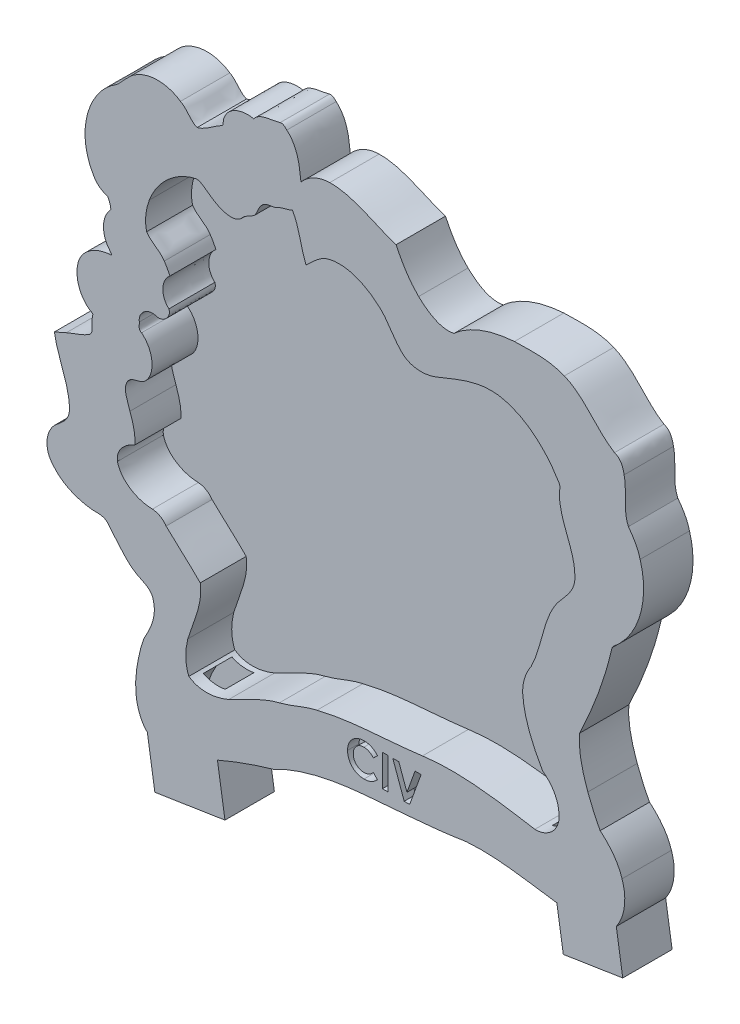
from build123d import *

# Parameters (mm, degrees)
BOSS_EXTRUDE1_DEPTH = 8.6
BOSS_EXTRUDE2_DEPTH = 0.6
BOSS_EXTRUDE3_DEPTH = 8.6
CUT_EXTRUDE1_DEPTH  = 9
CUT_EXTRUDE3_DEPTH  = 7
CUT_EXTRUDE4_DEPTH  = 5
BOSS_EXTRUDE4_DEPTH = 2
FILLET1_R           = 1.2
SKETCH8_W           = 12.358072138
SKETCH8_H           = 8.6
SKETCH8_W_2         = 6.650626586
SKETCH8_H_2         = 5
SKETCH8_W_3         = 10.47326114
SKETCH8_W_4         = 6.059963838
BOSS_EXTRUDE5_DEPTH = 6
SKETCH9_W           = 0.987179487
SKETCH9_H           = 5.5
CUT_EXTRUDE5_DEPTH  = 2


with BuildPart() as part:
    # Model → Boss-Extrude1 (new body)
    with BuildSketch(Plane.XY):
        with BuildLine():
            add(Edge.make_bspline(
                [(84.777274, 159.10405), (84.468177, 159.41369), (84.088604, 159.79081), (83.609375, 159.64258)],
                knots=[0, 0, 0, 0, 1, 1, 1, 1], degree=3))
            add(Edge.make_bspline(
                [(83.609375, 159.64258), (82.141161, 159.19474), (80.077447, 159.37023), (79.03125, 157.92578)],
                knots=[0, 0, 0, 0, 1, 1, 1, 1], degree=3))
            add(Edge.make_bspline(
                [(79.03125, 157.92578), (77.084114, 158.34017), (74.613561, 157.5729), (73.886163, 155.55754)],
                knots=[0, 0, 0, 0, 1, 1, 1, 1], degree=3))
            add(Edge.make_bspline(
                [(73.886163, 155.55754), (73.629028, 155.13557), (73.796103, 154.52343), (73.542969, 154.17969)],
                knots=[0, 0, 0, 0, 1, 1, 1, 1], degree=3))
            add(Edge.make_bspline(
                [(73.542969, 154.17969), (72.044006, 153.40073), (70.800965, 152.12238), (69.142578, 151.66602)],
                knots=[0, 0, 0, 0, 1, 1, 1, 1], degree=3))
            add(Edge.make_bspline(
                [(69.142578, 151.66602), (67.938616, 152.18434), (67.426087, 153.57769), (66.252499, 154.16312)],
                knots=[0, 0, 0, 0, 1, 1, 1, 1], degree=3))
            add(Edge.make_bspline(
                [(66.252499, 154.16312), (63.628824, 156.0179), (59.782498, 155.70484), (57.445387, 153.51493)],
                knots=[0, 0, 0, 0, 1, 1, 1, 1], degree=3))
            add(Edge.make_bspline(
                [(57.445387, 153.51493), (56.380806, 152.58489), (55.637907, 151.30748), (54.359375, 150.63281)],
                knots=[0, 0, 0, 0, 1, 1, 1, 1], degree=3))
            add(Edge.make_bspline(
                [(54.359375, 150.63281), (49.840483, 147.27546), (48.17057, 140.42041), (51.099609, 135.51562)],
                knots=[0, 0, 0, 0, 1, 1, 1, 1], degree=3))
            add(Edge.make_bspline(
                [(51.099609, 135.51562), (51.548143, 134.48517), (52.556507, 133.82301), (53.591797, 133.47852)],
                knots=[0, 0, 0, 0, 1, 1, 1, 1], degree=3))
            add(Edge.make_bspline(
                [(53.591797, 133.47852), (53.913485, 132.99047), (54.090052, 132.3166), (54.136719, 131.78516)],
                knots=[0, 0, 0, 0, 1, 1, 1, 1], degree=3))
            add(Edge.make_bspline(
                [(54.136719, 131.78516), (52.5399, 130.17487), (52.407137, 127.38825), (53.874883, 125.64915)],
                knots=[0, 0, 0, 0, 1, 1, 1, 1], degree=3))
            add(Edge.make_bspline(
                [(53.874883, 125.64915), (54.20396, 125.21086), (54.557045, 124.85928), (53.745025, 124.9402)],
                knots=[0, 0, 0, 0, 1, 1, 1, 1], degree=3))
            add(Edge.make_bspline(
                [(53.745025, 124.9402), (51.364138, 124.68498), (48.857309, 123.16093), (48.372928, 120.66886)],
                knots=[0, 0, 0, 0, 1, 1, 1, 1], degree=3))
            add(Edge.make_bspline(
                [(48.372928, 120.66886), (47.876912, 118.39673), (48.781595, 115.64199), (50.943697, 114.56226)],
                knots=[0, 0, 0, 0, 1, 1, 1, 1], degree=3))
            add(Edge.make_bspline(
                [(50.943697, 114.56226), (51.097487, 114.28234), (50.78108, 113.74694), (50.837891, 113.35352)],
                knots=[0, 0, 0, 0, 1, 1, 1, 1], degree=3))
            add(Edge.make_bspline(
                [(50.837891, 113.35352), (50.752211, 112.57159), (51.180243, 111.59567), (50.358109, 111.0754)],
                knots=[0, 0, 0, 0, 1, 1, 1, 1], degree=3))
            add(Edge.make_bspline(
                [(50.358109, 111.0754), (49.141954, 110.27494), (47.679958, 109.94679), (46.365234, 109.33789)],
                knots=[0, 0, 0, 0, 1, 1, 1, 1], degree=3))
            add(Edge.make_bspline(
                [(46.365234, 109.33789), (45.672135, 109.04939), (44.989226, 108.73772), (44.304688, 108.42969)],
                knots=[0, 0, 0, 0, 1, 1, 1, 1], degree=3))
            add(Edge.make_bspline(
                [(44.304688, 108.42969), (44.85508, 104.79267), (47.090446, 101.51388), (46.90625, 97.75586)],
                knots=[0, 0, 0, 0, 1, 1, 1, 1], degree=3))
            add(Edge.make_bspline(
                [(46.90625, 97.75586), (46.780681, 96.24275), (45.45133, 95.30477), (44.383935, 94.42033)],
                knots=[0, 0, 0, 0, 1, 1, 1, 1], degree=3))
            add(Edge.make_bspline(
                [(44.383935, 94.42033), (42.816741, 92.8466), (42.466403, 90.06665), (43.987901, 88.34007)],
                knots=[0, 0, 0, 0, 1, 1, 1, 1], degree=3))
            add(Edge.make_bspline(
                [(43.987901, 88.34007), (45.613584, 86.21692), (48.318639, 85.18661), (50.90625, 84.92188)],
                knots=[0, 0, 0, 0, 1, 1, 1, 1], degree=3))
            add(Edge.make_bspline(
                [(50.90625, 84.92188), (51.914018, 84.91588), (53.14548, 84.99338), (53.777156, 84.03101)],
                knots=[0, 0, 0, 0, 1, 1, 1, 1], degree=3))
            add(Edge.make_bspline(
                [(53.777156, 84.03101), (55.458497, 82.17471), (56.824453, 79.87312), (59.189593, 78.79146)],
                knots=[0, 0, 0, 0, 1, 1, 1, 1], degree=3))
            add(Edge.make_bspline(
                [(59.189593, 78.79146), (60.175291, 78.34588), (61.306432, 77.79058), (61.510856, 76.60474)],
                knots=[0, 0, 0, 0, 1, 1, 1, 1], degree=3))
            add(Edge.make_bspline(
                [(61.510856, 76.60474), (62.179142, 74.27785), (61.002486, 71.97806), (59.886719, 70)],
                knots=[0, 0, 0, 0, 1, 1, 1, 1], degree=3))
            add(Edge.make_bspline(
                [(59.886719, 70), (59.253545, 68.32192), (58.923581, 66.53876), (58.633837, 64.77322)],
                knots=[0, 0, 0, 0, 1, 1, 1, 1], degree=3))
            add(Edge.make_bspline(
                [(58.633837, 64.77322), (58.272795, 62.16539), (58.32458, 59.28321), (59.785156, 56.99805)],
                knots=[0, 0, 0, 0, 1, 1, 1, 1], degree=3))
            add(Edge.make_bspline(
                [(59.785156, 56.99805), (60.921031, 55.34014), (63.056631, 54.04296), (65.095163, 54.66478)],
                knots=[0, 0, 0, 0, 1, 1, 1, 1], degree=3))
            add(Edge.make_bspline(
                [(65.095163, 54.66478), (67.679095, 55.67918), (70.119506, 57.02079), (72.694339, 58.05993)],
                knots=[0, 0, 0, 0, 1, 1, 1, 1], degree=3))
            add(Edge.make_bspline(
                [(72.694339, 58.05993), (75.888521, 59.43673), (79.111415, 60.60095), (82.455078, 61.54102)],
                knots=[0, 0, 0, 0, 1, 1, 1, 1], degree=3))
            add(Edge.make_bspline(
                [(82.455078, 61.54102), (87.319231, 64.16138), (92.959143, 65.15362), (98.437342, 65.64746)],
                knots=[0, 0, 0, 0, 1, 1, 1, 1], degree=3))
            add(Edge.make_bspline(
                [(98.437342, 65.64746), (104.28334, 66.18985), (110.16312, 66.46583), (115.96309, 67.41091)],
                knots=[0, 0, 0, 0, 1, 1, 1, 1], degree=3))
            add(Edge.make_bspline(
                [(115.96309, 67.41091), (123.48644, 68.02547), (130.76223, 65.62781), (138.2699, 65.58984)],
                knots=[0, 0, 0, 0, 1, 1, 1, 1], degree=3))
            add(Edge.make_bspline(
                [(138.2699, 65.58984), (139.65001, 65.41252), (140.98553, 66.12685), (141.78042, 67.23289)],
                knots=[0, 0, 0, 0, 1, 1, 1, 1], degree=3))
            add(Edge.make_bspline(
                [(141.78042, 67.23289), (143.63628, 69.47282), (144.0926, 72.66155), (143.14309, 75.38475)],
                knots=[0, 0, 0, 0, 1, 1, 1, 1], degree=3))
            add(Edge.make_bspline(
                [(143.14309, 75.38475), (142.48654, 77.52852), (141.01884, 79.30607), (139.33398, 80.73633)],
                knots=[0, 0, 0, 0, 1, 1, 1, 1], degree=3))
            add(Edge.make_bspline(
                [(139.33398, 80.73633), (138.47369, 82.27666), (137.81532, 83.9058), (137.1875, 85.5)],
                knots=[0, 0, 0, 0, 1, 1, 1, 1], degree=3))
            add(Edge.make_bspline(
                [(137.1875, 85.5), (136.2405, 88.08813), (135.503, 90.87195), (135.74381, 93.63733)],
                knots=[0, 0, 0, 0, 1, 1, 1, 1], degree=3))
            add(Edge.make_bspline(
                [(135.74381, 93.63733), (138.16903, 98.66062), (140.17845, 103.90679), (141.39686, 109.35659)],
                knots=[0, 0, 0, 0, 1, 1, 1, 1], degree=3))
            add(Edge.make_bspline(
                [(141.39686, 109.35659), (141.6693, 109.91296), (142.34758, 110.1873), (142.73674, 110.68477)],
                knots=[0, 0, 0, 0, 1, 1, 1, 1], degree=3))
            add(Edge.make_bspline(
                [(142.73674, 110.68477), (146.44498, 114.36532), (147.81684, 120.13631), (146.28908, 125.1169)],
                knots=[0, 0, 0, 0, 1, 1, 1, 1], degree=3))
            add(Edge.make_bspline(
                [(146.28908, 125.1169), (145.94595, 126.57367), (145.13855, 127.86313), (144.25434, 129.03914)],
                knots=[0, 0, 0, 0, 1, 1, 1, 1], degree=3))
            add(Edge.make_bspline(
                [(144.25434, 129.03914), (143.24678, 131.39664), (144.06997, 134.02262), (143.50195, 136.46875)],
                knots=[0, 0, 0, 0, 1, 1, 1, 1], degree=3))
            add(Edge.make_bspline(
                [(143.50195, 136.46875), (143.35348, 137.49579), (142.91279, 138.62965), (141.83984, 138.98242)],
                knots=[0, 0, 0, 0, 1, 1, 1, 1], degree=3))
            add(Edge.make_bspline(
                [(141.83984, 138.98242), (138.58984, 140.97524), (136.70518, 144.70986), (133.09255, 146.19165)],
                knots=[0, 0, 0, 0, 1, 1, 1, 1], degree=3))
            add(Edge.make_bspline(
                [(133.09255, 146.19165), (130.35081, 147.32411), (127.30994, 147.07447), (124.41314, 147.03829)],
                knots=[0, 0, 0, 0, 1, 1, 1, 1], degree=3))
            add(Edge.make_bspline(
                [(124.41314, 147.03829), (120.61848, 146.77934), (116.74935, 145.58235), (113.88477, 142.99414)],
                knots=[0, 0, 0, 0, 1, 1, 1, 1], degree=3))
            add(Edge.make_bspline(
                [(113.88477, 142.99414), (111.54639, 142.4763), (109.35134, 143.95652), (107.72414, 145.47911)],
                knots=[0, 0, 0, 0, 1, 1, 1, 1], degree=3))
            add(Edge.make_bspline(
                [(107.72414, 145.47911), (106.01903, 147.12893), (104.80917, 149.20956), (103.80469, 151.33984)],
                knots=[0, 0, 0, 0, 1, 1, 1, 1], degree=3))
            add(Edge.make_bspline(
                [(103.80469, 151.33984), (99.956761, 152.52601), (96.404354, 155.0099), (92.241428, 154.91561)],
                knots=[0, 0, 0, 0, 1, 1, 1, 1], degree=3))
            add(Edge.make_bspline(
                [(92.241428, 154.91561), (90.325709, 154.89451), (88.47389, 153.94986), (87.238281, 152.50195)],
                knots=[0, 0, 0, 0, 1, 1, 1, 1], degree=3))
            add(Edge.make_bspline(
                [(87.238281, 152.50195), (87.007138, 154.83975), (86.658092, 157.46441), (84.777274, 159.10405)],
                knots=[0, 0, 0, 0, 1, 1, 1, 1], degree=3))
        make_face()
        with BuildLine():
            Line((85.681641, 147.48438), (85.757812, 147.5156))
            add(Edge.make_bspline(
                [(88.107422, 140.43748), (87.156385, 142.74207), (87.008605, 145.33338), (85.757812, 147.5156)],
                knots=[0, 0, 0, 0, 1, 1, 1, 1], degree=3))
            add(Edge.make_bspline(
                [(91.570461, 143.12642), (90.19888, 142.55245), (89.197091, 141.40538), (88.107422, 140.43748)],
                knots=[0, 0, 0, 0, 1, 1, 1, 1], degree=3))
            add(Edge.make_bspline(
                [(100.50977, 140.791), (98.121047, 142.86258), (94.688008, 144.19285), (91.570461, 143.12642)],
                knots=[0, 0, 0, 0, 1, 1, 1, 1], degree=3))
            add(Edge.make_bspline(
                [(104.69922, 135.7031), (103.12008, 137.25044), (102.30638, 139.44097), (100.50977, 140.791)],
                knots=[0, 0, 0, 0, 1, 1, 1, 1], degree=3))
            add(Edge.make_bspline(
                [(110.68761, 134.83691), (108.73076, 134.09977), (106.23355, 134.08409), (104.69922, 135.7031)],
                knots=[0, 0, 0, 0, 1, 1, 1, 1], degree=3))
            add(Edge.make_bspline(
                [(121.56076, 137.55119), (117.72325, 138.00381), (114.16041, 136.1769), (110.68761, 134.83691)],
                knots=[0, 0, 0, 0, 1, 1, 1, 1], degree=3))
            add(Edge.make_bspline(
                [(132.00747, 129.84895), (129.80466, 133.57708), (126.03678, 136.88787), (121.56076, 137.55119)],
                knots=[0, 0, 0, 0, 1, 1, 1, 1], degree=3))
            add(Edge.make_bspline(
                [(132.24059, 128.09973), (132.28939, 128.71011), (132.49444, 129.34951), (132.00747, 129.84895)],
                knots=[0, 0, 0, 0, 1, 1, 1, 1], degree=3))
            add(Edge.make_bspline(
                [(134.92773, 116.72264), (135.04959, 120.72322), (132.12261, 124.10104), (132.24059, 128.09973)],
                knots=[0, 0, 0, 0, 1, 1, 1, 1], degree=3))
            add(Edge.make_bspline(
                [(132.02702, 111.5261), (133.25207, 113.07313), (134.98725, 114.57336), (134.92773, 116.72264)],
                knots=[0, 0, 0, 0, 1, 1, 1, 1], degree=3))
            add(Edge.make_bspline(
                [(127.33094, 99.51803), (129.28315, 103.36659), (129.31382, 108.03558), (132.02702, 111.5261)],
                knots=[0, 0, 0, 0, 1, 1, 1, 1], degree=3))
            add(Edge.make_bspline(
                [(125.84648, 94.70584), (125.76148, 96.43155), (126.38089, 98.10414), (127.33094, 99.51803)],
                knots=[0, 0, 0, 0, 1, 1, 1, 1], degree=3))
            add(Edge.make_bspline(
                [(129.31836, 84.71873), (127.55306, 87.77795), (126.06737, 91.13889), (125.84648, 94.70584)],
                knots=[0, 0, 0, 0, 1, 1, 1, 1], degree=3))
            add(Edge.make_bspline(
                [(132.16016, 79.35154), (132.21996, 81.47708), (131.03946, 83.51705), (129.31836, 84.71873)],
                knots=[0, 0, 0, 0, 1, 1, 1, 1], degree=3))
            add(Edge.make_bspline(
                [(127.96132, 75.25623), (130.17311, 75.15023), (132.29016, 77.09312), (132.16016, 79.35154)],
                knots=[0, 0, 0, 0, 1, 1, 1, 1], degree=3))
            add(Edge.make_bspline(
                [(108.39726, 76.54069), (114.93639, 77.4379), (121.51792, 76.32783), (127.96132, 75.25623)],
                knots=[0, 0, 0, 0, 1, 1, 1, 1], degree=3))
            add(Edge.make_bspline(
                [(90.032689, 74.25223), (96.043142, 75.75683), (102.30238, 75.70623), (108.39726, 76.54069)],
                knots=[0, 0, 0, 0, 1, 1, 1, 1], degree=3))
            add(Edge.make_bspline(
                [(83.479116, 72.08373), (85.720293, 72.63612), (87.76964, 73.76368), (90.032689, 74.25223)],
                knots=[0, 0, 0, 0, 1, 1, 1, 1], degree=3))
            add(Edge.make_bspline(
                [(74.674295, 68.1915), (77.61364, 69.4782), (80.319672, 71.33531), (83.479116, 72.08373)],
                knots=[0, 0, 0, 0, 1, 1, 1, 1], degree=3))
            add(Edge.make_bspline(
                [(67.712891, 68.1875), (69.77754, 66.78018), (72.514987, 67.25506), (74.674295, 68.1915)],
                knots=[0, 0, 0, 0, 1, 1, 1, 1], degree=3))
            add(Edge.make_bspline(
                [(67.533203, 73.75195), (67.083035, 71.9353), (66.977161, 69.94571), (67.712891, 68.1875)],
                knots=[0, 0, 0, 0, 1, 1, 1, 1], degree=3))
            add(Edge.make_bspline(
                [(69.699219, 83.28125), (70.164582, 79.92827), (68.42213, 76.87363), (67.533203, 73.75195)],
                knots=[0, 0, 0, 0, 1, 1, 1, 1], degree=3))
            add(Edge.make_bspline(
                [(63.756112, 88.87367), (65.691999, 86.96187), (67.807507, 85.23863), (69.699219, 83.28125)],
                knots=[0, 0, 0, 0, 1, 1, 1, 1], degree=3))
            add(Edge.make_bspline(
                [(61.36512, 90.2389), (62.327259, 90.1837), (63.225479, 89.67271), (63.756112, 88.87367)],
                knots=[0, 0, 0, 0, 1, 1, 1, 1], degree=3))
            add(Edge.make_bspline(
                [(55.28125, 94.38281), (55.963136, 91.74776), (58.808244, 90.30499), (61.36512, 90.2389)],
                knots=[0, 0, 0, 0, 1, 1, 1, 1], degree=3))
            add(Edge.make_bspline(
                [(58.314453, 98.38672), (56.71591, 97.74491), (55.00402, 96.28347), (55.28125, 94.38281)],
                knots=[0, 0, 0, 0, 1, 1, 1, 1], degree=3))
            add(Edge.make_bspline(
                [(57.458364, 103.05389), (57.993998, 101.56089), (58.452303, 99.99063), (58.314453, 98.38672)],
                knots=[0, 0, 0, 0, 1, 1, 1, 1], degree=3))
            add(Edge.make_bspline(
                [(57.029297, 107.32031), (56.201774, 105.95555), (57.043617, 104.40152), (57.458364, 103.05389)],
                knots=[0, 0, 0, 0, 1, 1, 1, 1], degree=3))
            add(Edge.make_bspline(
                [(59.96875, 108.80859), (59.06305, 108.07737), (57.67634, 108.40941), (57.029297, 107.32031)],
                knots=[0, 0, 0, 0, 1, 1, 1, 1], degree=3))
            add(Edge.make_bspline(
                [(59.46875, 115.88867), (61.577874, 114.25614), (62.036218, 110.6537), (59.96875, 108.80859)],
                knots=[0, 0, 0, 0, 1, 1, 1, 1], degree=3))
            add(Edge.make_bspline(
                [(59.092019, 117.33561), (59.120599, 116.8423), (58.874201, 116.12241), (59.46875, 115.88867)],
                knots=[0, 0, 0, 0, 1, 1, 1, 1], degree=3))
            add(Edge.make_bspline(
                [(62.158203, 119.63477), (60.710656, 120.2653), (58.858607, 118.92796), (59.092019, 117.33561)],
                knots=[0, 0, 0, 0, 1, 1, 1, 1], degree=3))
            add(Edge.make_bspline(
                [(64.245555, 121.88344), (64.663353, 120.7167), (63.372078, 119.39146), (62.158203, 119.63477)],
                knots=[0, 0, 0, 0, 1, 1, 1, 1], degree=3))
            add(Edge.make_bspline(
                [(64.425781, 126.92383), (62.881413, 125.7278), (62.742364, 123.16713), (64.245555, 121.88344)],
                knots=[0, 0, 0, 0, 1, 1, 1, 1], degree=3))
            add(Edge.make_bspline(
                [(63.438508, 128.67166), (63.838976, 128.13226), (64.113944, 127.51546), (64.425781, 126.92383)],
                knots=[0, 0, 0, 0, 1, 1, 1, 1], degree=3))
            add(Edge.make_bspline(
                [(60.371094, 131.57227), (61.12557, 130.34534), (62.677853, 129.91076), (63.438508, 128.67166)],
                knots=[0, 0, 0, 0, 1, 1, 1, 1], degree=3))
            add(Edge.make_bspline(
                [(60.824103, 136.57173), (60.256458, 134.99075), (59.955673, 133.21783), (60.371094, 131.57227)],
                knots=[0, 0, 0, 0, 1, 1, 1, 1], degree=3))
            add(Edge.make_bspline(
                [(69.083412, 143.89142), (65.315125, 143.10436), (62.169394, 140.13324), (60.824103, 136.57173)],
                knots=[0, 0, 0, 0, 1, 1, 1, 1], degree=3))
            add(Edge.make_bspline(
                [(72.189008, 142.07664), (71.12207, 142.61362), (70.290287, 143.70087), (69.083412, 143.89142)],
                knots=[0, 0, 0, 0, 1, 1, 1, 1], degree=3))
            add(Edge.make_bspline(
                [(76.847463, 141.79286), (75.501166, 140.61898), (73.533237, 141.22623), (72.189008, 142.07664)],
                knots=[0, 0, 0, 0, 1, 1, 1, 1], degree=3))
            add(Edge.make_bspline(
                [(79.199219, 143.48047), (78.459432, 142.84888), (77.388427, 142.64993), (76.847463, 141.79286)],
                knots=[0, 0, 0, 0, 1, 1, 1, 1], degree=3))
            add(Edge.make_bspline(
                [(80.438813, 145.58777), (79.819668, 145.01994), (79.654631, 144.12998), (79.199219, 143.48047)],
                knots=[0, 0, 0, 0, 1, 1, 1, 1], degree=3))
            add(Edge.make_bspline(
                [(83.001376, 146.50076), (82.154743, 146.15491), (81.06421, 146.39581), (80.438813, 145.58777)],
                knots=[0, 0, 0, 0, 1, 1, 1, 1], degree=3))
            add(Edge.make_bspline(
                [(85.681641, 147.48438), (84.820765, 147.05893), (83.807682, 147.05547), (83.001376, 146.50076)],
                knots=[0, 0, 0, 0, 1, 1, 1, 1], degree=3))
        make_face(mode=Mode.SUBTRACT)
    extrude(amount=BOSS_EXTRUDE1_DEPTH)

    # Sketch2 → Boss-Extrude2 (add)
    with BuildSketch(Plane.XY):
        with BuildLine():
            add(Edge.make_bspline(
                [(85.959024, 149.27534), (85.136244, 149.08211), (84.411679, 148.50358), (83.53125, 148.55469)],
                knots=[0, 0, 0, 0, 1, 1, 1, 1], degree=3))
            add(Edge.make_bspline(
                [(83.53125, 148.55469), (82.880216, 148.40682), (82.417948, 147.70048), (81.703277, 147.87632)],
                knots=[0, 0, 0, 0, 1, 1, 1, 1], degree=3))
            add(Edge.make_bspline(
                [(81.703277, 147.87632), (79.931562, 147.73358), (78.569126, 146.23354), (78.058594, 144.61328)],
                knots=[0, 0, 0, 0, 1, 1, 1, 1], degree=3))
            add(Edge.make_bspline(
                [(78.058594, 144.61328), (77.428435, 144.07713), (76.442136, 143.99779), (76.009483, 143.20084)],
                knots=[0, 0, 0, 0, 1, 1, 1, 1], degree=3))
            add(Edge.make_bspline(
                [(76.009483, 143.20084), (75.563506, 142.58451), (74.77522, 142.62034), (74.153441, 142.90349)],
                knots=[0, 0, 0, 0, 1, 1, 1, 1], degree=3))
            add(Edge.make_bspline(
                [(74.153441, 142.90349), (72.441761, 143.46073), (71.220121, 144.99192), (69.527344, 145.54102)],
                knots=[0, 0, 0, 0, 1, 1, 1, 1], degree=3))
            add(Edge.make_bspline(
                [(69.527344, 145.54102), (68.031369, 145.53202), (66.643955, 144.81669), (65.33745, 144.15664)],
                knots=[0, 0, 0, 0, 1, 1, 1, 1], degree=3))
            add(Edge.make_bspline(
                [(65.33745, 144.15664), (61.063505, 141.7378), (58.060432, 136.79579), (58.66357, 131.81553)],
                knots=[0, 0, 0, 0, 1, 1, 1, 1], degree=3))
            add(Edge.make_bspline(
                [(58.66357, 131.81553), (58.771561, 130.7199), (59.501499, 129.82367), (60.430243, 129.28789)],
                knots=[0, 0, 0, 0, 1, 1, 1, 1], degree=3))
            add(Edge.make_bspline(
                [(60.430243, 129.28789), (61.209459, 128.67895), (62.125179, 128.03573), (62.529297, 127.13086)],
                knots=[0, 0, 0, 0, 1, 1, 1, 1], degree=3))
            add(Edge.make_bspline(
                [(62.529297, 127.13086), (61.194257, 125.47774), (61.276645, 122.91992), (62.646484, 121.32031)],
                knots=[0, 0, 0, 0, 1, 1, 1, 1], degree=3))
            add(Edge.make_bspline(
                [(62.646484, 121.32031), (62.521392, 121.01864), (62.084249, 121.43927), (61.838388, 121.35261)],
                knots=[0, 0, 0, 0, 1, 1, 1, 1], degree=3))
            add(Edge.make_bspline(
                [(61.838388, 121.35261), (59.81373, 121.6143), (57.59944, 120.08356), (57.549631, 117.94975)],
                knots=[0, 0, 0, 0, 1, 1, 1, 1], degree=3))
            add(Edge.make_bspline(
                [(57.549631, 117.94975), (57.421663, 117.00127), (57.472541, 116.03053), (57.703125, 115.10151)],
                knots=[0, 0, 0, 0, 1, 1, 1, 1], degree=3))
            add(Edge.make_bspline(
                [(57.703125, 115.10151), (59.481766, 114.37443), (60.380211, 111.9589), (59.220925, 110.3442)],
                knots=[0, 0, 0, 0, 1, 1, 1, 1], degree=3))
            add(Edge.make_bspline(
                [(59.220925, 110.3442), (58.869092, 109.60036), (57.887801, 109.94475), (57.298211, 109.51916)],
                knots=[0, 0, 0, 0, 1, 1, 1, 1], degree=3))
            add(Edge.make_bspline(
                [(57.298211, 109.51916), (55.770678, 108.85549), (54.791427, 107.13697), (55.142578, 105.48237)],
                knots=[0, 0, 0, 0, 1, 1, 1, 1], degree=3))
            add(Edge.make_bspline(
                [(55.142578, 105.48237), (55.350632, 103.3588), (56.68768, 101.49854), (56.716797, 99.34565)],
                knots=[0, 0, 0, 0, 1, 1, 1, 1], degree=3))
            add(Edge.make_bspline(
                [(56.716797, 99.34565), (54.785421, 98.33398), (53.164283, 96.1246), (53.763946, 93.86478)],
                knots=[0, 0, 0, 0, 1, 1, 1, 1], degree=3))
            add(Edge.make_bspline(
                [(53.763946, 93.86478), (54.516106, 90.93497), (57.463739, 89.15129), (60.304688, 88.72261)],
                knots=[0, 0, 0, 0, 1, 1, 1, 1], degree=3))
            add(Edge.make_bspline(
                [(60.304688, 88.72261), (60.959344, 88.51035), (61.834, 88.90315), (62.224607, 88.15557)],
                knots=[0, 0, 0, 0, 1, 1, 1, 1], degree=3))
            add(Edge.make_bspline(
                [(62.224607, 88.15557), (64.107837, 86.20226), (66.259038, 84.52947), (68.150391, 82.58393)],
                knots=[0, 0, 0, 0, 1, 1, 1, 1], degree=3))
            add(Edge.make_bspline(
                [(68.150391, 82.58393), (68.418273, 79.22512), (66.270547, 76.34332), (65.769531, 73.10933)],
                knots=[0, 0, 0, 0, 1, 1, 1, 1], degree=3))
            add(Edge.make_bspline(
                [(65.769531, 73.10933), (65.436925, 71.16654), (65.516257, 69.05948), (66.378225, 67.26473)],
                knots=[0, 0, 0, 0, 1, 1, 1, 1], degree=3))
            add(Edge.make_bspline(
                [(66.378225, 67.26473), (66.920662, 66.49543), (67.938665, 66.27225), (68.78125, 65.97065)],
                knots=[0, 0, 0, 0, 1, 1, 1, 1], degree=3))
            add(Edge.make_bspline(
                [(68.78125, 65.97065), (71.525545, 65.24163), (74.387296, 66.12562), (76.803849, 67.44559)],
                knots=[0, 0, 0, 0, 1, 1, 1, 1], degree=3))
            add(Edge.make_bspline(
                [(76.803849, 67.44559), (79.360201, 68.71653), (81.853212, 70.23486), (84.723907, 70.72844)],
                knots=[0, 0, 0, 0, 1, 1, 1, 1], degree=3))
            add(Edge.make_bspline(
                [(84.723907, 70.72844), (86.652823, 71.39139), (88.494283, 72.31128), (90.502407, 72.737)],
                knots=[0, 0, 0, 0, 1, 1, 1, 1], degree=3))
            add(Edge.make_bspline(
                [(90.502407, 72.737), (96.516809, 74.24539), (102.74072, 74.08391), (108.85083, 75.0252)],
                knots=[0, 0, 0, 0, 1, 1, 1, 1], degree=3))
            add(Edge.make_bspline(
                [(108.85083, 75.0252), (115.02796, 75.72786), (121.1862, 74.86926), (127.26106, 73.70841)],
                knots=[0, 0, 0, 0, 1, 1, 1, 1], degree=3))
            add(Edge.make_bspline(
                [(127.26106, 73.70841), (129.99315, 73.32881), (133.02234, 75.0915), (133.55837, 77.89953)],
                knots=[0, 0, 0, 0, 1, 1, 1, 1], degree=3))
            add(Edge.make_bspline(
                [(133.55837, 77.89953), (134.29777, 80.82102), (132.91359, 84.01491), (130.53711, 85.77925)],
                knots=[0, 0, 0, 0, 1, 1, 1, 1], degree=3))
            add(Edge.make_bspline(
                [(130.53711, 85.77925), (129.53297, 87.36196), (128.86151, 89.11647), (128.20017, 90.89727)],
                knots=[0, 0, 0, 0, 1, 1, 1, 1], degree=3))
            add(Edge.make_bspline(
                [(128.20017, 90.89727), (127.56095, 92.82513), (127.13987, 94.8346), (127.6925, 96.83567)],
                knots=[0, 0, 0, 0, 1, 1, 1, 1], degree=3))
            add(Edge.make_bspline(
                [(127.6925, 96.83567), (128.3613, 98.20931), (129.26454, 99.4718), (129.67217, 100.96594)],
                knots=[0, 0, 0, 0, 1, 1, 1, 1], degree=3))
            add(Edge.make_bspline(
                [(129.67217, 100.96594), (130.85858, 104.3517), (131.21918, 108.09024), (133.56651, 110.9528)],
                knots=[0, 0, 0, 0, 1, 1, 1, 1], degree=3))
            add(Edge.make_bspline(
                [(133.56651, 110.9528), (135.04258, 112.48811), (136.54458, 114.33576), (136.50668, 116.58648)],
                knots=[0, 0, 0, 0, 1, 1, 1, 1], degree=3))
            add(Edge.make_bspline(
                [(136.50668, 116.58648), (136.70718, 119.84364), (134.95487, 122.73935), (134.11444, 125.74983)],
                knots=[0, 0, 0, 0, 1, 1, 1, 1], degree=3))
            add(Edge.make_bspline(
                [(134.11444, 125.74983), (133.76975, 126.93648), (133.69233, 128.22338), (134.06254, 129.41401)],
                knots=[0, 0, 0, 0, 1, 1, 1, 1], degree=3))
            add(Edge.make_bspline(
                [(134.06254, 129.41401), (131.72256, 134.06238), (127.50139, 138.027), (122.2891, 139.0644)],
                knots=[0, 0, 0, 0, 1, 1, 1, 1], degree=3))
            add(Edge.make_bspline(
                [(122.2891, 139.0644), (118.41886, 139.71342), (114.62895, 138.21909), (111.14717, 136.69622)],
                knots=[0, 0, 0, 0, 1, 1, 1, 1], degree=3))
            add(Edge.make_bspline(
                [(111.14717, 136.69622), (109.67928, 136.15805), (107.88809, 135.45564), (106.41996, 136.35542)],
                knots=[0, 0, 0, 0, 1, 1, 1, 1], degree=3))
            add(Edge.make_bspline(
                [(106.41996, 136.35542), (104.81686, 137.3748), (104.2322, 139.3259), (102.92573, 140.64025)],
                knots=[0, 0, 0, 0, 1, 1, 1, 1], degree=3))
            add(Edge.make_bspline(
                [(102.92573, 140.64025), (100.36359, 143.50317), (96.50971, 145.57178), (92.582028, 145.01022)],
                knots=[0, 0, 0, 0, 1, 1, 1, 1], degree=3))
            add(Edge.make_bspline(
                [(92.582028, 145.01022), (91.195934, 144.86793), (89.878978, 144.2027), (88.884806, 143.27534)],
                knots=[0, 0, 0, 0, 1, 1, 1, 1], degree=3))
            add(Edge.make_bspline(
                [(88.884806, 143.27534), (88.276871, 145.27946), (87.966181, 147.49191), (86.564493, 149.14057)],
                knots=[0, 0, 0, 0, 1, 1, 1, 1], degree=3))
            add(Edge.make_bspline(
                [(86.564493, 149.14057), (86.37492, 149.23327), (86.172499, 149.29673), (85.959024, 149.27534)],
                knots=[0, 0, 0, 0, 1, 1, 1, 1], degree=3))
        make_face()
    extrude(amount=BOSS_EXTRUDE2_DEPTH)

    # Sketch3 → Boss-Extrude3 (add, through all)
    with BuildSketch(Plane.XY.offset(8.6)):
        Polygon((60.484460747, 56.151836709), (72.694339, 58.05993), (73.080340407, 55.589909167), (60.870462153, 53.681815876), align=None)
        Polygon((131.792476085, 66.086250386), (142.140145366, 67.703327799), (142.526146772, 65.233306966), (132.178477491, 63.616229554), align=None)
    extrude(amount=-BOSS_EXTRUDE3_DEPTH)

    # Sketch4 → Cut-Extrude1 (cut)
    with BuildSketch(Plane.XY.offset(8.6)):
        Polygon((131.994012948, 64.796617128), (142.341682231, 66.413694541), (142.533129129, 65.188626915), (132.185459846, 63.571549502), align=None)
    extrude(amount=-CUT_EXTRUDE1_DEPTH, mode=Mode.SUBTRACT)

    # Sketch5 → Cut-Extrude3 (cut)
    with BuildSketch(Plane.XY.offset(8.6)):
        with BuildLine():
            ThreePointArc((129.757960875, 72.88789247), (132.970543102, 69.581857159), (134.219204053, 65.144357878))
            Line((134.219204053, 65.144357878), (140.206498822, 66.080019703))
            ThreePointArc((140.206498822, 66.080019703), (140.114895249, 73.074512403), (135.050260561, 77.89953))
            ThreePointArc((135.050260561, 77.89953), (133.016990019, 74.746509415), (129.757960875, 72.88789247))
        make_face()
        with BuildLine():
            ThreePointArc((66.395616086, 66.437383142), (63.753708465, 60.591780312), (64.097447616, 54.186111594))
            Line((64.097447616, 54.186111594), (70.668322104, 55.21297208))
            ThreePointArc((70.668322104, 55.21297208), (70.483208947, 55.632437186), (70.321082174, 56.06131102))
            ThreePointArc((70.321082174, 56.06131102), (70.170497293, 59.535704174), (71.699922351, 62.658994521))
            ThreePointArc((71.699922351, 62.658994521), (72.687007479, 63.757448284), (73.620937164, 64.901438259))
            ThreePointArc((73.620937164, 64.901438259), (69.853145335, 64.93964924), (66.395616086, 66.437383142))
        make_face()
    extrude(amount=-CUT_EXTRUDE3_DEPTH, mode=Mode.SUBTRACT)

    # Sketch6 → Cut-Extrude4 (cut)
    with BuildSketch(Plane.XY.offset(1.6)):
        with BuildLine():
            Line((132.057703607, 79.322084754), (129.019711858, 75.467428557))
            ThreePointArc((129.019711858, 75.467428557), (129.098722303, 74.094631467), (129.757960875, 72.88789247))
            ThreePointArc((129.757960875, 72.88789247), (133.576424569, 74.155745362), (135.050260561, 77.89953))
            ThreePointArc((135.050260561, 77.89953), (133.46179429, 78.416876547), (132.057703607, 79.322084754))
        make_face()
        with BuildLine():
            ThreePointArc((66.395616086, 66.437383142), (69.619675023, 63.841368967), (73.620937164, 64.90143826))
            ThreePointArc((73.620937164, 64.90143826), (70.519642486, 68.0749544), (66.395616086, 66.437383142))
        make_face()
    extrude(amount=CUT_EXTRUDE4_DEPTH, mode=Mode.SUBTRACT)

    # Sketch7 → Boss-Extrude4 (add)
    with BuildSketch(Plane.XY.offset(8.6)):
        with BuildLine():
            Line((64.097447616, 54.186111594), (70.668322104, 55.21297208))
            ThreePointArc((70.668322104, 55.21297208), (72.732783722, 59.877961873), (73.620937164, 64.90143826))
            ThreePointArc((73.620937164, 64.90143826), (69.986025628, 65.564738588), (66.395616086, 66.437383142))
            ThreePointArc((66.395616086, 66.437383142), (62.403911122, 60.844983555), (64.097447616, 54.186111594))
        make_face()
        with BuildLine():
            Line((134.219204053, 65.144357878), (140.206498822, 66.080019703))
            ThreePointArc((140.206498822, 66.080019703), (140.90140147, 73.661244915), (135.042915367, 78.522932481))
            ThreePointArc((135.042915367, 78.522932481), (132.603026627, 75.107883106), (129.136664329, 72.741461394))
            ThreePointArc((129.136664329, 72.741461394), (131.536018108, 68.847966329), (134.219204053, 65.144357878))
        make_face()
    extrude(amount=-BOSS_EXTRUDE4_DEPTH)

    # Fillet1
    fillet1_edges = [part.edges().sort_by_distance(p)[0] for p in [
        (135.050260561, 77.89953, 4.1),
        (129.757960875, 72.88789247, 4.1),
    ]]
    fillet(fillet1_edges, radius=FILLET1_R)

    # Sketch8 → Boss-Extrude5 (add)
    # profile 1 of 2: a face of its own
    with BuildSketch(Plane(origin=(-6.737986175, 43.116335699, 0), x_dir=(-0.9880083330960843, -0.15440056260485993, 0), z_dir=(0.15440056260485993, -0.9880083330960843, 0))):
        with Locations((-74.608062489, -4.3)):
            Rectangle(SKETCH8_W, SKETCH8_H)
        with Locations((-75.020491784, -4.1)):
            Rectangle(SKETCH8_W_2, SKETCH8_H_2, mode=Mode.SUBTRACT)
    # profile 2 of 2: a face of its own
    with BuildSketch(Plane(origin=(-6.737986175, 43.116335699, 0), x_dir=(-0.9880083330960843, -0.15440056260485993, 0), z_dir=(0.15440056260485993, -0.9880083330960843, 0))):
        with Locations((-145.652449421, -4.3)):
            Rectangle(SKETCH8_W_3, SKETCH8_H)
        with Locations((-145.697999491, -4.1)):
            Rectangle(SKETCH8_W_4, SKETCH8_H_2, mode=Mode.SUBTRACT)
    extrude(amount=BOSS_EXTRUDE5_DEPTH)

    # Sketch9 → Cut-Extrude5 (cut)
    with BuildSketch(Plane.XY.offset(8.6)):
        with BuildLine():
            Line((100.576586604, 72.651305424), (99.852728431, 71.959398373))
            add(Edge.make_bspline(
                [(99.852728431, 71.959398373), (99.791324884, 72.022889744), (99.671384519, 72.146908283), (99.478115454, 72.311097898), (99.277122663, 72.447927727), (99.072316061, 72.563164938), (98.860011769, 72.650350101), (98.642664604, 72.713883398), (98.41888674, 72.752617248), (98.267442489, 72.757049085), (98.191270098, 72.759278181)],
                knots=[0, 0, 0, 0, 1.115251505, 2.178435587, 3.19620269, 4.182487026, 5.141301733, 6.088180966, 7.038406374, 8, 8, 8, 8], degree=3))
            add(Edge.make_bspline(
                [(98.191270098, 72.759278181), (98.127656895, 72.757517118), (98.002123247, 72.754041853), (97.817806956, 72.728564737), (97.641498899, 72.685239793), (97.472595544, 72.625529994), (97.311593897, 72.548268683), (97.158156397, 72.453515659), (97.01266134, 72.342126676), (96.87703063, 72.214678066), (96.752960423, 72.075430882), (96.643336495, 71.926854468), (96.55150887, 71.769289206), (96.476147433, 71.6043308), (96.417443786, 71.431215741), (96.375522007, 71.250060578), (96.35127557, 71.060649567), (96.347656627, 70.931889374), (96.345817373, 70.866449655)],
                knots=[0, 0, 0, 0, 1.035432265, 2.043311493, 3.022114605, 3.98653278, 4.95457646, 5.923598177, 6.917315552, 7.932509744, 8.948865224, 9.949768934, 10.933144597, 11.912367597, 12.897413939, 13.903909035, 14.934704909, 16, 16, 16, 16], degree=3))
            add(Edge.make_bspline(
                [(96.345817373, 70.866449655), (96.346347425, 70.820519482), (96.347392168, 70.729990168), (96.358828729, 70.596072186), (96.377244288, 70.466140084), (96.403896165, 70.340390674), (96.437224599, 70.218714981), (96.476326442, 70.100063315), (96.525379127, 69.986075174), (96.579828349, 69.875426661), (96.643152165, 69.771136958), (96.711426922, 69.671688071), (96.785459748, 69.577567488), (96.865730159, 69.489159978), (96.953367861, 69.407847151), (97.046107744, 69.331183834), (97.145514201, 69.26108917), (97.249522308, 69.195804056), (97.359030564, 69.139090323), (97.471067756, 69.087718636), (97.587332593, 69.045997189), (97.706409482, 69.012365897), (97.827872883, 68.983767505), (97.952910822, 68.966158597), (98.080439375, 68.952823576), (98.166627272, 68.952000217), (98.210000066, 68.951585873)],
                knots=[0, 0, 0, 0, 1.103660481, 2.175337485, 3.227646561, 4.255952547, 5.262355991, 6.258840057, 7.255597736, 8.242457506, 9.22035537, 10.185017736, 11.140346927, 12.096287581, 13.051739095, 14.01125915, 14.986044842, 15.97314143, 16.960198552, 17.947847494, 18.933482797, 19.925264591, 20.920966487, 21.929612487, 22.958107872, 24, 24, 24, 24], degree=3))
            add(Edge.make_bspline(
                [(98.210000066, 68.951585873), (98.283567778, 68.953713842), (98.428109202, 68.957894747), (98.640244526, 68.990588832), (98.842388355, 69.044368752), (99.003900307, 69.107879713), (99.130440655, 69.170597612), (99.226773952, 69.228608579), (99.326390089, 69.293500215), (99.427634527, 69.367721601), (99.531646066, 69.45038205), (99.636588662, 69.54329198), (99.745148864, 69.643392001), (99.816265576, 69.714835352), (99.852728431, 69.751465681)],
                knots=[0, 0, 0, 0, 1.404581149, 2.759636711, 4.088442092, 5.392261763, 6.066678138, 6.783632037, 7.538459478, 8.336747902, 9.180226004, 10.074962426, 11.012997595, 12, 12, 12, 12], degree=3))
            Line((99.852728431, 69.751465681), (100.554551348, 69.014386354))
            add(Edge.make_bspline(
                [(100.554551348, 69.014386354), (100.505216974, 68.966755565), (100.408926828, 68.873790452), (100.263675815, 68.741788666), (100.118607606, 68.623170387), (99.977226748, 68.513630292), (99.837217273, 68.416359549), (99.69859403, 68.331261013), (99.562926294, 68.25618242), (99.427396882, 68.192389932), (99.291162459, 68.138223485), (99.150993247, 68.091589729), (99.006460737, 68.052139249), (98.856682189, 68.020307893), (98.703054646, 67.994783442), (98.544140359, 67.977554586), (98.380946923, 67.965972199), (98.270250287, 67.964931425), (98.214407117, 67.964406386)],
                knots=[0, 0, 0, 0, 1.244526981, 2.429050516, 3.560637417, 4.644440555, 5.67424972, 6.652764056, 7.595344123, 8.486817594, 9.369275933, 10.254498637, 11.166417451, 12.086725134, 13.032340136, 13.991389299, 14.986715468, 16, 16, 16, 16], degree=3))
            add(Edge.make_bspline(
                [(98.214407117, 67.964406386), (98.111830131, 67.967021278), (97.911115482, 67.972137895), (97.616973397, 68.01004856), (97.337546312, 68.073605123), (97.072154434, 68.163491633), (96.82088215, 68.278317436), (96.583793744, 68.41908848), (96.361271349, 68.585430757), (96.155112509, 68.775394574), (95.968632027, 68.985193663), (95.803804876, 69.210460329), (95.667459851, 69.452301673), (95.554249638, 69.707144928), (95.465720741, 69.976153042), (95.403411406, 70.259616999), (95.364985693, 70.557263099), (95.360781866, 70.760562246), (95.358637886, 70.86424613)],
                knots=[0, 0, 0, 0, 1.078019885, 2.10938526, 3.111377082, 4.085535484, 5.04941344, 6.010039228, 6.978205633, 7.964457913, 8.951525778, 9.924444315, 10.892603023, 11.863865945, 12.85144698, 13.863884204, 14.910567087, 16, 16, 16, 16], degree=3))
            add(Edge.make_bspline(
                [(95.358637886, 70.86424613), (95.359543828, 70.931867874), (95.361339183, 71.065877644), (95.380208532, 71.263284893), (95.406513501, 71.455721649), (95.448243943, 71.641189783), (95.498545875, 71.822187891), (95.561102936, 71.996748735), (95.635815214, 72.165374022), (95.720274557, 72.32834604), (95.815822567, 72.484597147), (95.922560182, 72.6327849), (96.037739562, 72.774053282), (96.164128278, 72.906528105), (96.299889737, 73.031372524), (96.445636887, 73.147909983), (96.600493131, 73.25781176), (96.764877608, 73.358243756), (96.935596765, 73.449089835), (97.110497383, 73.529219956), (97.289149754, 73.596190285), (97.470798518, 73.651739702), (97.656211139, 73.693203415), (97.844064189, 73.724590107), (98.035956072, 73.742135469), (98.164794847, 73.745007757), (98.229831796, 73.746457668)],
                knots=[0, 0, 0, 0, 1.071919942, 2.124283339, 3.142214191, 4.149696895, 5.136002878, 6.119640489, 7.086990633, 8.058538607, 9.028339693, 9.988281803, 10.952401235, 11.916291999, 12.888973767, 13.874849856, 14.873389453, 15.898127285, 16.927174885, 17.938320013, 18.946391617, 19.950418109, 20.947802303, 21.956882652, 22.968648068, 24, 24, 24, 24], degree=3))
            add(Edge.make_bspline(
                [(98.229831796, 73.746457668), (98.285314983, 73.745626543), (98.395704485, 73.743972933), (98.560092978, 73.730188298), (98.723166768, 73.708539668), (98.884342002, 73.675876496), (99.04477157, 73.637101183), (99.202347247, 73.586330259), (99.359554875, 73.529736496), (99.513928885, 73.462090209), (99.665684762, 73.388248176), (99.811267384, 73.304471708), (99.953121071, 73.215916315), (100.08810243, 73.117340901), (100.218739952, 73.01232098), (100.344350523, 72.900366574), (100.463831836, 72.779611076), (100.538811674, 72.694290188), (100.576586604, 72.651305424)],
                knots=[0, 0, 0, 0, 0.996412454, 1.982464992, 2.961075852, 3.949442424, 4.934965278, 5.923860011, 6.921385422, 7.934793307, 8.949617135, 9.951082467, 10.950285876, 11.951772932, 12.951063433, 13.960125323, 14.972308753, 16, 16, 16, 16], degree=3))
        make_face()
        with Locations((101.916330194, 70.855432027)):
            Rectangle(SKETCH9_W, SKETCH9_H)
        Polygon((103.220817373, 73.605432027), (104.275204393, 73.605432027), (105.688766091, 69.698581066), (107.103429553, 73.605432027), (108.156714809, 73.605432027), (106.163625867, 68.105432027), (105.21170279, 68.105432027), align=None)
    extrude(amount=-CUT_EXTRUDE5_DEPTH, mode=Mode.SUBTRACT)


solid = part.part
